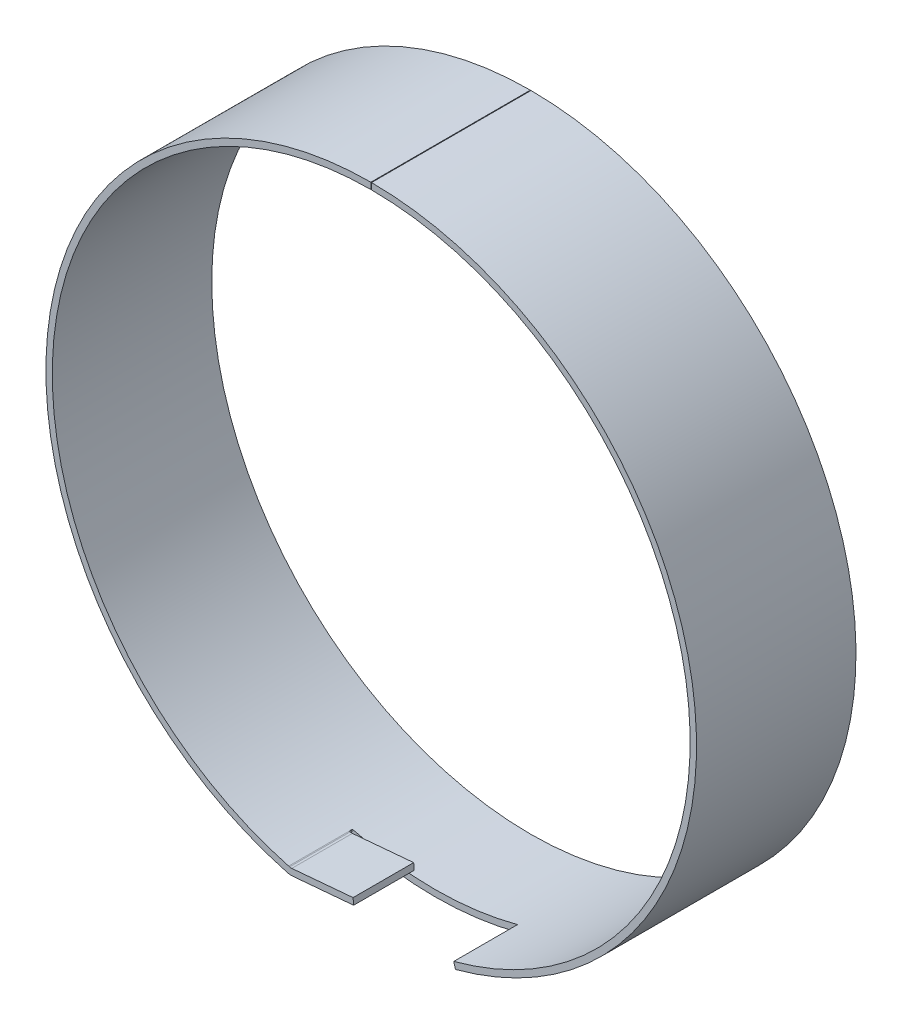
from build123d import *

# Parameters (mm, degrees)
SKIZZE1_R                       = 102
SKIZZE1_R_2                     = 100
LINEAR_AUSTRAGEN_D_NN1_DEPTH    = 50
SKIZZE2_W                       = 0.2
SKIZZE2_H                       = 102
SCHNITT_LINEAR_AUSTRAGEN1_DEPTH = 153.669577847
SCHNITT_LINEAR_START            = -20
SCHNITT_LINEAR_AUSTRAGEN2_DEPTH = 20
LINEAR_AUSTRAGEN1_DEPTH         = 19
LINEAR_START                    = -19
LINEAR_AUSTRAGEN2_DEPTH         = 19
VERRUNDUNG1_R                   = 4
VERRUNDUNG2_R                   = 2


with BuildPart() as part:
    # Skizze1 → Linear-Austragen-D_nn1 (new body)
    with BuildSketch(Plane.XY):
        Circle(SKIZZE1_R)
        Circle(SKIZZE1_R_2, mode=Mode.SUBTRACT)
    extrude(amount=LINEAR_AUSTRAGEN_D_NN1_DEPTH)

    # Skizze2 → Schnitt-Linear austragen1 (cut, through all)
    with BuildSketch(Plane.XY.offset(50)):
        with Locations((0, 51)):
            Rectangle(SKIZZE2_W, SKIZZE2_H)
    extrude(amount=-SCHNITT_LINEAR_AUSTRAGEN1_DEPTH, mode=Mode.SUBTRACT)

    # Skizze3 → Schnitt-Linear austragen2 (cut)
    with BuildSketch(Plane.XY.offset(50).offset(SCHNITT_LINEAR_START)):
        with BuildLine():
            Line((0, 0), (-26.3995426, -98.524434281))
            ThreePointArc((-26.3995426, -98.524434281), (0, -102), (26.3995426, -98.524434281))
            Line((26.3995426, -98.524434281), (0, 0))
        make_face()
    extrude(amount=SCHNITT_LINEAR_AUSTRAGEN2_DEPTH, mode=Mode.SUBTRACT)

    # Skizze4 → Linear austragen1 (add)
    with BuildSketch(Plane.XY.offset(50)):
        Polygon((-25.88190451, -96.592582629), (-26.3995426, -98.524434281), (-25.433616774, -98.783253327), (-24.915978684, -96.851401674), align=None)
    extrude(amount=-LINEAR_AUSTRAGEN1_DEPTH)

    # Skizze9 → Linear austragen2 (add)
    with BuildSketch(Plane.XY.offset(50).offset(LINEAR_START)):
        Polygon((-25.433616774, -98.783253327), (-25.60792826, -96.79086393), (-5.684034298, -95.047749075), (-5.509722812, -97.040138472), align=None)
    extrude(amount=LINEAR_AUSTRAGEN2_DEPTH)

    # Verrundung1
    verrundung1_edges = [part.edges().sort_by_distance(p)[0] for p in [
        (-25.433616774, -98.783253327, 40.5),
    ]]
    fillet(verrundung1_edges, radius=VERRUNDUNG1_R)

    # Verrundung2
    verrundung2_edges = [part.edges().sort_by_distance(p)[0] for p in [
        (-25.256616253, -96.760128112, 40.5),
    ]]
    fillet(verrundung2_edges, radius=VERRUNDUNG2_R)


solid = part.part
